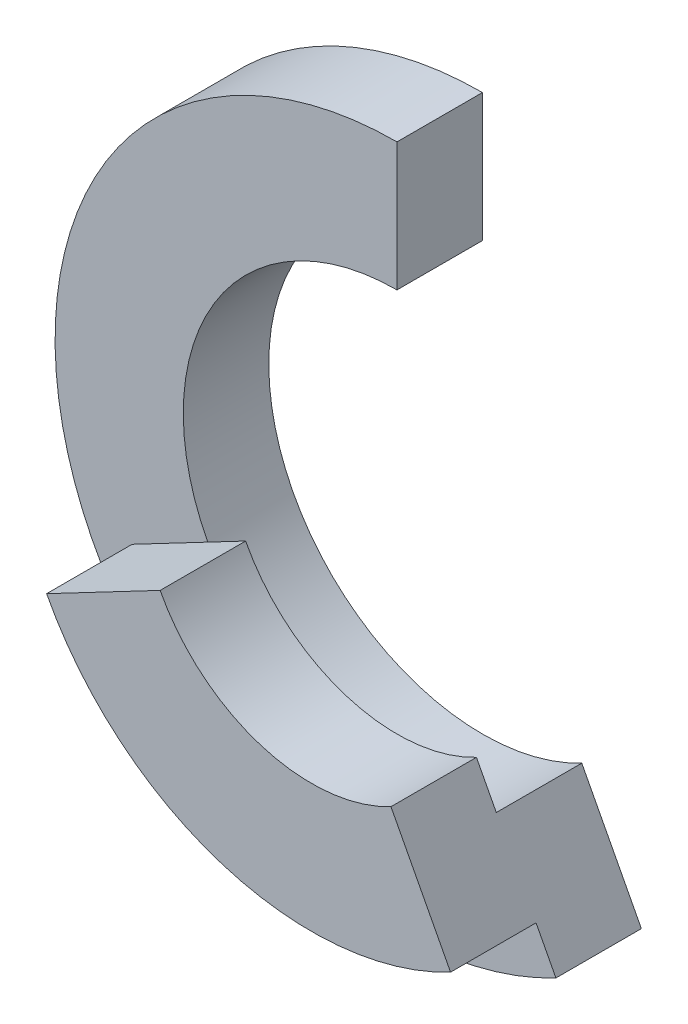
from build123d import *

# Parameters (mm, degrees)
EXTRUDE_THIN1_DEPTH = 10
EXTRUDE_THIN2_DEPTH = 10


with BuildPart() as part:
    # Sketch1 → Extrude-Thin1 (new body)
    with BuildSketch(Plane.XY):
        with BuildLine():
            ThreePointArc((18.591951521, -35.416653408), (-38.837263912, -9.574284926), (0, 40))
            Line((0, 40), (0, 25))
            ThreePointArc((0, 25), (-24.273289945, -5.983928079), (11.619969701, -22.13540838))
            Line((11.619969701, -22.13540838), (18.591951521, -35.416653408))
        make_face()
    extrude(amount=-EXTRUDE_THIN1_DEPTH)

    # Sketch4 → Extrude-Thin2 (add)
    with BuildSketch(Plane.XY):
        with BuildLine():
            ThreePointArc((16.267957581, -30.989571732), (-10.409753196, -33.416119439), (-30.989571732, -16.267957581))
            Line((-30.989571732, -16.267957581), (-17.708326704, -9.295975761))
            ThreePointArc((-17.708326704, -9.295975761), (-5.948430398, -19.094925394), (9.295975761, -17.708326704))
            Line((9.295975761, -17.708326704), (16.267957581, -30.989571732))
        make_face()
    extrude(amount=EXTRUDE_THIN2_DEPTH)


solid = part.part
